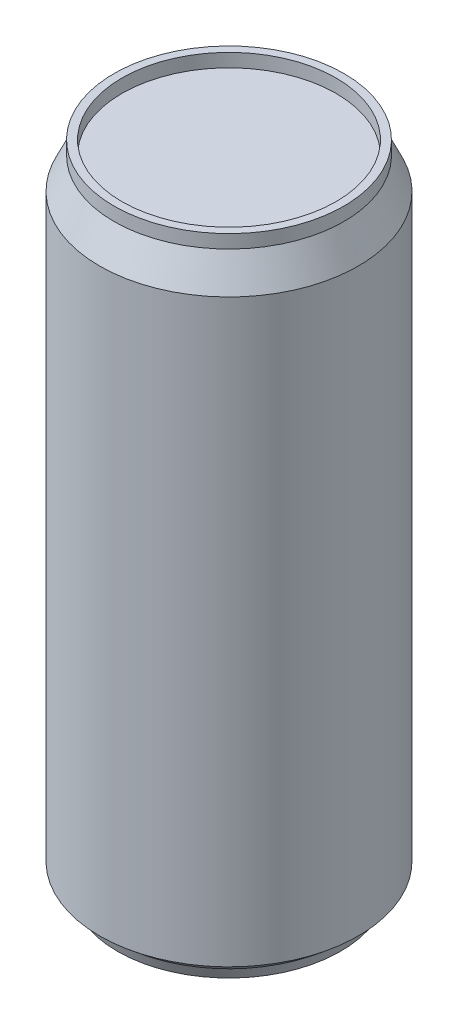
from build123d import *


with BuildPart() as part:
    # Esquisse1 → R_volution1 (revolve)
    with BuildSketch(Plane.XY, mode=Mode.PRIVATE) as r_volution1_sk:
        with BuildLine():
            Line((0, 142), (-24, 142))
            Line((-24, 142), (-24, 145))
            Line((-24, 145), (-25.75, 145))
            Line((-25.75, 145), (-25.75, 142))
            Line((-25.75, 142), (-29, 135))
            Line((-29, 135), (-29, 5))
            Line((-29, 5), (-26, 2.5))
            Line((-26, 2.5), (-25, 0))
            Line((-25, 0), (-22, 0))
            Line((-22, 0), (-22, 2.5))
            ThreePointArc((-22, 2.5), (-11.621639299, 8.073475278), (0, 10))
            Line((0, 10), (0, 142))
        make_face()
    revolve(r_volution1_sk.sketch.rotate(Axis((0, 142, 0), (0, -1, 0)), 270), axis=Axis((0, 142, 0), (0, -1, 0)))


solid = part.part
